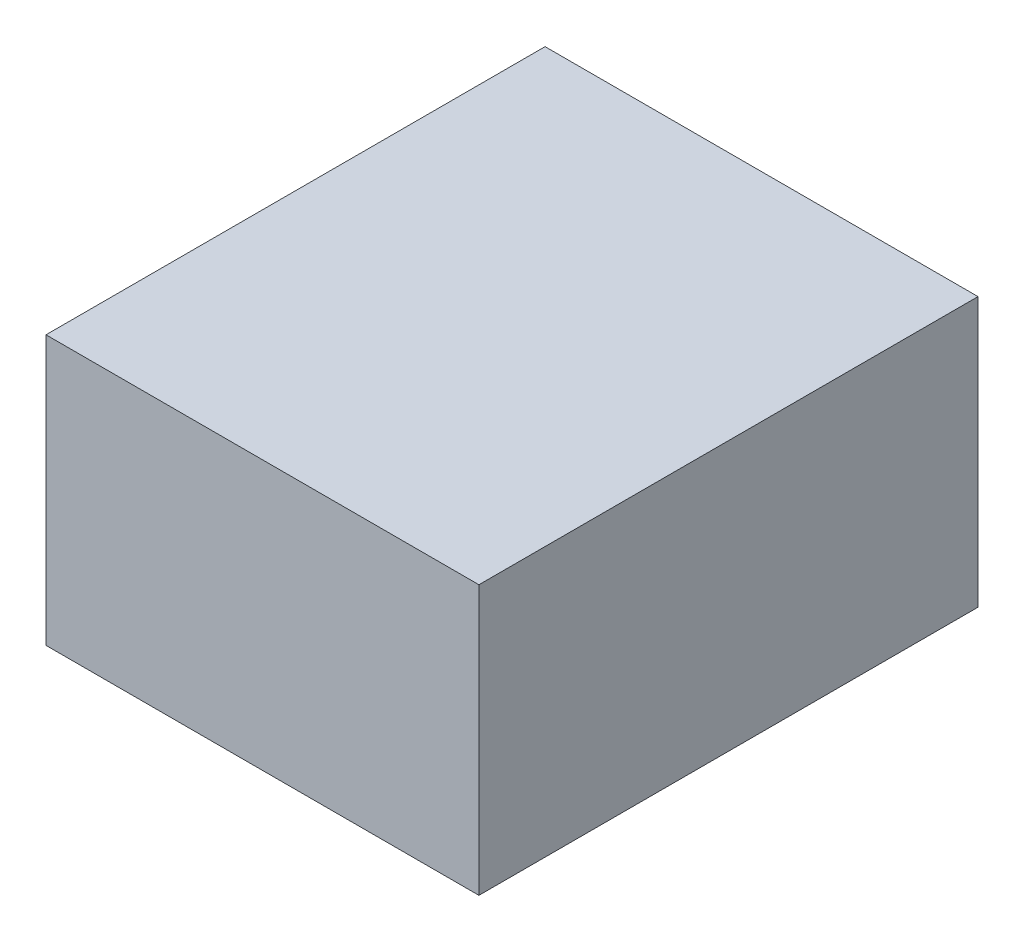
from build123d import *

# Parameters (mm, degrees)
SKETCH1_W      = 127.515795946
SKETCH1_H      = 79.236694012
EXTRUDE1_DEPTH = 73.5


with BuildPart() as part:
    # Sketch1 → Extrude1 (new, symmetric)
    with BuildSketch(Plane.XY):
        Rectangle(SKETCH1_W, SKETCH1_H)
    extrude(amount=EXTRUDE1_DEPTH, both=True)


solid = part.part
